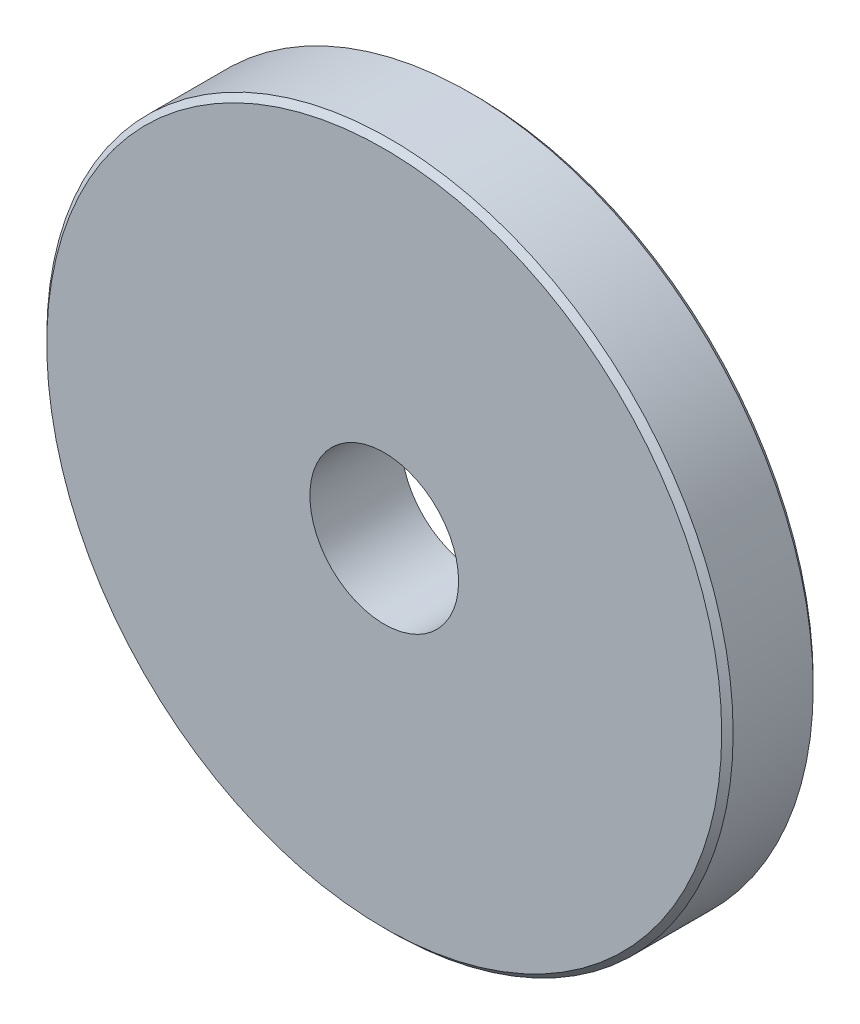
from build123d import *

# Parameters (mm, degrees)
ESQUISSE1_R      = 30
ESQUISSE1_R_2    = 6.5
EXTRUSION1_DEPTH = 8
CHANFREIN1_SIZE  = 0.5


with BuildPart() as part:
    # Esquisse1 → Extrusion1 (new body)
    with BuildSketch(Plane.XY):
        Circle(ESQUISSE1_R)
        Circle(ESQUISSE1_R_2, mode=Mode.SUBTRACT)
    extrude(amount=EXTRUSION1_DEPTH)

    # Chanfrein1
    chanfrein1_edges = [part.edges().sort_by_distance(p)[0] for p in [
        (-30, 0, 0),
        (-30, 0, 8),
    ]]
    chamfer(chanfrein1_edges, length=CHANFREIN1_SIZE)


solid = part.part
